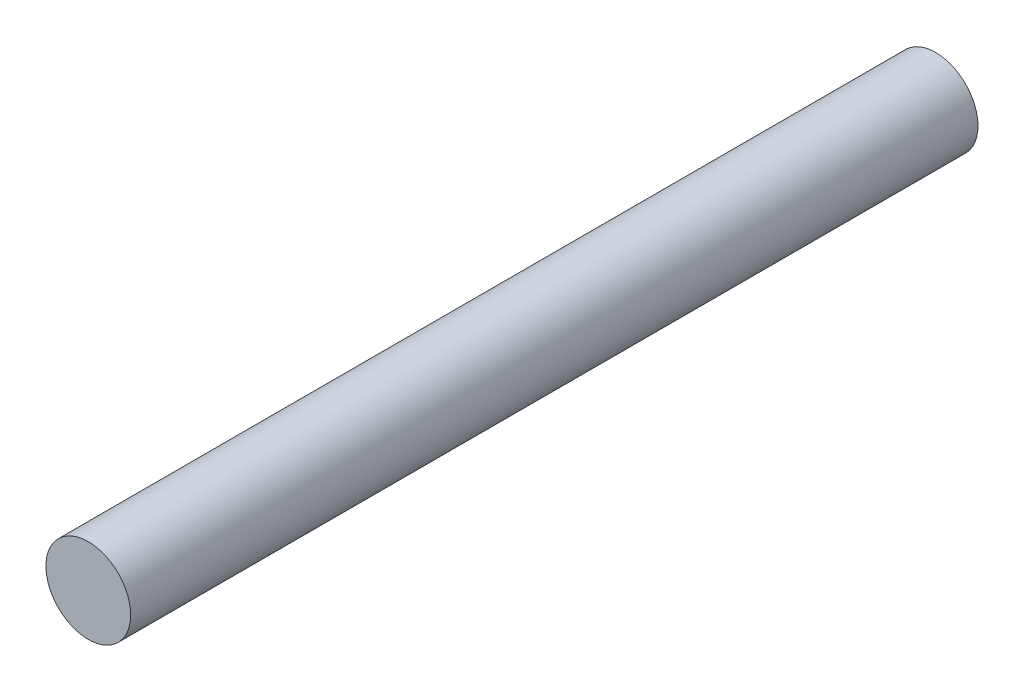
ISO-10303-21;
HEADER;
FILE_DESCRIPTION(('STEP AP214'),'2;1');
FILE_NAME('part.step','',(''),(''),'','','');
FILE_SCHEMA(('AUTOMOTIVE_DESIGN { 1 0 10303 214 1 1 1 1 }'));
ENDSEC;
DATA;
#1=APPLICATION_CONTEXT('core data for automotive mechanical design processes');
#2=APPLICATION_PROTOCOL_DEFINITION('international standard','automotive_design',2000,#1);
#3=PRODUCT_CONTEXT('',#1,'mechanical');
#4=PRODUCT('Part','Part','',(#3));
#5=PRODUCT_RELATED_PRODUCT_CATEGORY('part','',(#4));
#6=PRODUCT_DEFINITION_FORMATION('','',#4);
#7=PRODUCT_DEFINITION_CONTEXT('part definition',#1,'design');
#8=PRODUCT_DEFINITION('design','',#6,#7);
#9=PRODUCT_DEFINITION_SHAPE('','',#8);
#10=(LENGTH_UNIT() NAMED_UNIT(*) SI_UNIT(.MILLI.,.METRE.));
#11=(NAMED_UNIT(*) PLANE_ANGLE_UNIT() SI_UNIT($,.RADIAN.));
#12=(NAMED_UNIT(*) SI_UNIT($,.STERADIAN.) SOLID_ANGLE_UNIT());
#13=UNCERTAINTY_MEASURE_WITH_UNIT(LENGTH_MEASURE(1.E-05),#10,'distance_accuracy_value','');
#14=(GEOMETRIC_REPRESENTATION_CONTEXT(3) GLOBAL_UNCERTAINTY_ASSIGNED_CONTEXT((#13)) GLOBAL_UNIT_ASSIGNED_CONTEXT((#10,
#11,#12)) REPRESENTATION_CONTEXT('',''));
#15=CARTESIAN_POINT('',(0.,0.,0.));
#16=DIRECTION('',(0.,0.,1.));
#17=DIRECTION('',(1.,0.,0.));
#18=AXIS2_PLACEMENT_3D('',#15,#16,#17);
#19=CARTESIAN_POINT('',(0.,0.,254.));
#20=DIRECTION('',(0.,0.,-1.));
#21=DIRECTION('',(-1.,0.,0.));
#22=AXIS2_PLACEMENT_3D('',#19,#20,#21);
#23=CYLINDRICAL_SURFACE('',#22,12.7);
#24=CARTESIAN_POINT('',(0.,0.,254.));
#25=DIRECTION('',(0.,0.,1.));
#26=DIRECTION('',(1.,0.,0.));
#27=AXIS2_PLACEMENT_3D('',#24,#25,#26);
#28=CIRCLE('',#27,12.7);
#29=CARTESIAN_POINT('',(12.7,0.,254.));
#30=VERTEX_POINT('',#29);
#31=EDGE_CURVE('E10',#30,#30,#28,.T.);
#32=ORIENTED_EDGE('',*,*,#31,.F.);
#33=EDGE_LOOP('',(#32));
#34=FACE_BOUND('',#33,.T.);
#35=CARTESIAN_POINT('',(0.,0.,0.));
#36=DIRECTION('',(0.,0.,1.));
#37=DIRECTION('',(1.,0.,0.));
#38=AXIS2_PLACEMENT_3D('',#35,#36,#37);
#39=CIRCLE('',#38,12.7);
#40=CARTESIAN_POINT('',(12.7,0.,0.));
#41=VERTEX_POINT('',#40);
#42=EDGE_CURVE('E34',#41,#41,#39,.T.);
#43=ORIENTED_EDGE('',*,*,#42,.T.);
#44=EDGE_LOOP('',(#43));
#45=FACE_BOUND('',#44,.T.);
#46=ADVANCED_FACE('F31',(#34,#45),#23,.T.);
#47=CARTESIAN_POINT('',(0.,0.,254.));
#48=DIRECTION('',(0.,0.,1.));
#49=DIRECTION('',(1.,0.,0.));
#50=AXIS2_PLACEMENT_3D('',#47,#48,#49);
#51=PLANE('',#50);
#52=ORIENTED_EDGE('',*,*,#31,.T.);
#53=EDGE_LOOP('',(#52));
#54=FACE_BOUND('',#53,.T.);
#55=ADVANCED_FACE('F46',(#54),#51,.T.);
#56=CARTESIAN_POINT('',(0.,0.,0.));
#57=DIRECTION('',(0.,0.,1.));
#58=DIRECTION('',(1.,0.,0.));
#59=AXIS2_PLACEMENT_3D('',#56,#57,#58);
#60=PLANE('',#59);
#61=ORIENTED_EDGE('',*,*,#42,.F.);
#62=EDGE_LOOP('',(#61));
#63=FACE_BOUND('',#62,.T.);
#64=ADVANCED_FACE('F44',(#63),#60,.F.);
#65=CLOSED_SHELL('',(#46,#55,#64));
#66=MANIFOLD_SOLID_BREP('B2',#65);
#67=ADVANCED_BREP_SHAPE_REPRESENTATION('',(#18,#66),#14);
#68=SHAPE_DEFINITION_REPRESENTATION(#9,#67);
ENDSEC;
END-ISO-10303-21;
